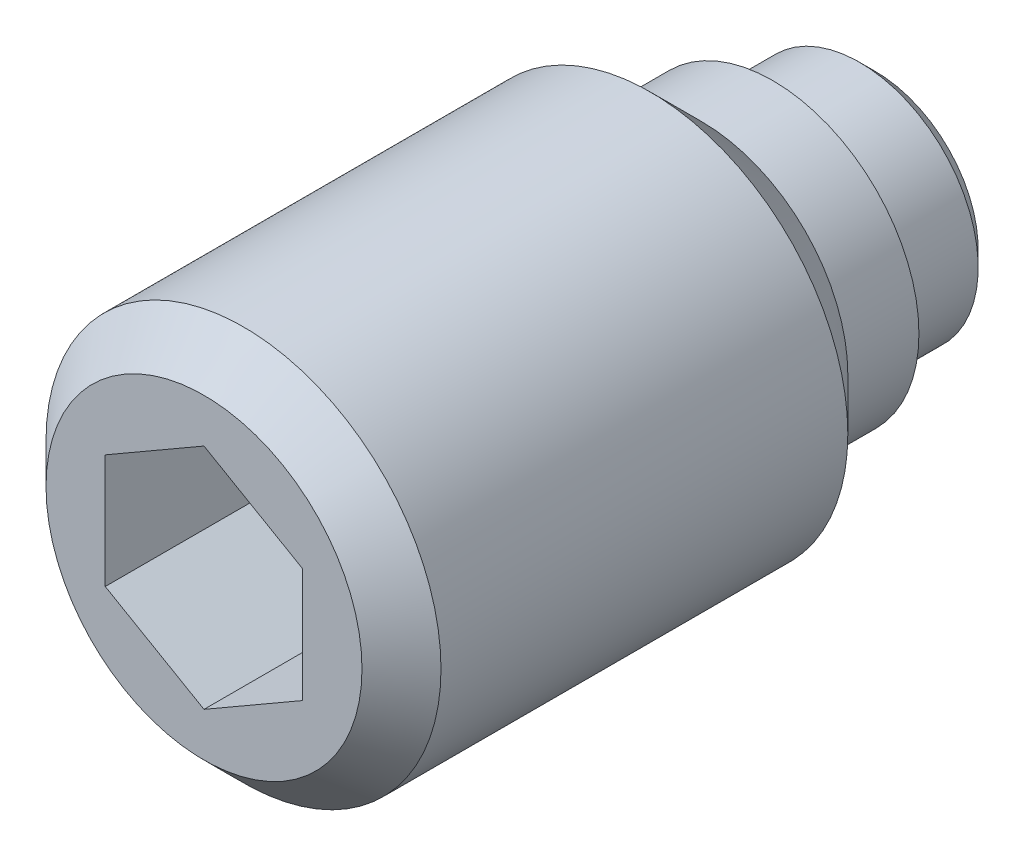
ISO-10303-21;
HEADER;
FILE_DESCRIPTION(('STEP AP214'),'2;1');
FILE_NAME('part.step','',(''),(''),'','','');
FILE_SCHEMA(('AUTOMOTIVE_DESIGN { 1 0 10303 214 1 1 1 1 }'));
ENDSEC;
DATA;
#1=APPLICATION_CONTEXT('core data for automotive mechanical design processes');
#2=APPLICATION_PROTOCOL_DEFINITION('international standard','automotive_design',2000,#1);
#3=PRODUCT_CONTEXT('',#1,'mechanical');
#4=PRODUCT('Part','Part','',(#3));
#5=PRODUCT_RELATED_PRODUCT_CATEGORY('part','',(#4));
#6=PRODUCT_DEFINITION_FORMATION('','',#4);
#7=PRODUCT_DEFINITION_CONTEXT('part definition',#1,'design');
#8=PRODUCT_DEFINITION('design','',#6,#7);
#9=PRODUCT_DEFINITION_SHAPE('','',#8);
#10=(LENGTH_UNIT() NAMED_UNIT(*) SI_UNIT(.MILLI.,.METRE.));
#11=(NAMED_UNIT(*) PLANE_ANGLE_UNIT() SI_UNIT($,.RADIAN.));
#12=(NAMED_UNIT(*) SI_UNIT($,.STERADIAN.) SOLID_ANGLE_UNIT());
#13=UNCERTAINTY_MEASURE_WITH_UNIT(LENGTH_MEASURE(1.E-05),#10,'distance_accuracy_value','');
#14=(GEOMETRIC_REPRESENTATION_CONTEXT(3) GLOBAL_UNCERTAINTY_ASSIGNED_CONTEXT((#13)) GLOBAL_UNIT_ASSIGNED_CONTEXT((#10,
#11,#12)) REPRESENTATION_CONTEXT('',''));
#15=CARTESIAN_POINT('',(0.,0.,0.));
#16=DIRECTION('',(0.,0.,1.));
#17=DIRECTION('',(1.,0.,0.));
#18=AXIS2_PLACEMENT_3D('',#15,#16,#17);
#19=CARTESIAN_POINT('',(0.,1.85,1.8));
#20=DIRECTION('',(0.,0.,1.));
#21=DIRECTION('',(1.,0.,0.));
#22=AXIS2_PLACEMENT_3D('',#19,#20,#21);
#23=PLANE('',#22);
#24=CARTESIAN_POINT('',(0.,0.,1.8));
#25=DIRECTION('',(0.,0.,-1.));
#26=DIRECTION('',(-1.,0.,0.));
#27=AXIS2_PLACEMENT_3D('',#24,#25,#26);
#28=CIRCLE('',#27,1.5);
#29=CARTESIAN_POINT('',(-1.5,0.,1.8));
#30=VERTEX_POINT('',#29);
#31=EDGE_CURVE('E103',#30,#30,#28,.T.);
#32=ORIENTED_EDGE('',*,*,#31,.F.);
#33=EDGE_LOOP('',(#32));
#34=FACE_BOUND('',#33,.T.);
#35=CARTESIAN_POINT('',(0.,0.,1.8));
#36=DIRECTION('',(0.,0.,-1.));
#37=DIRECTION('',(-1.,0.,0.));
#38=AXIS2_PLACEMENT_3D('',#35,#36,#37);
#39=CIRCLE('',#38,1.85);
#40=CARTESIAN_POINT('',(-1.85,0.,1.8));
#41=VERTEX_POINT('',#40);
#42=EDGE_CURVE('E123',#41,#41,#39,.T.);
#43=ORIENTED_EDGE('',*,*,#42,.T.);
#44=EDGE_LOOP('',(#43));
#45=FACE_BOUND('',#44,.T.);
#46=ADVANCED_FACE('F14',(#34,#45),#23,.F.);
#47=CARTESIAN_POINT('',(0.,0.,9.));
#48=DIRECTION('',(0.,0.,-1.));
#49=DIRECTION('',(-1.,0.,0.));
#50=AXIS2_PLACEMENT_3D('',#47,#48,#49);
#51=PLANE('',#50);
#52=CARTESIAN_POINT('',(0.,0.,9.));
#53=DIRECTION('',(0.,0.,-1.));
#54=DIRECTION('',(-1.,0.,0.));
#55=AXIS2_PLACEMENT_3D('',#52,#53,#54);
#56=CIRCLE('',#55,2.);
#57=CARTESIAN_POINT('',(-2.,0.,9.));
#58=VERTEX_POINT('',#57);
#59=EDGE_CURVE('E9',#58,#58,#56,.T.);
#60=ORIENTED_EDGE('',*,*,#59,.F.);
#61=EDGE_LOOP('',(#60));
#62=FACE_BOUND('',#61,.T.);
#63=DIRECTION('',(0.866025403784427,-0.50000000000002,0.));
#64=VECTOR('',#63,1.);
#65=CARTESIAN_POINT('',(0.,1.4433756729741,9.));
#66=LINE('',#65,#64);
#67=CARTESIAN_POINT('',(0.,1.4433756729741,9.));
#68=VERTEX_POINT('',#67);
#69=CARTESIAN_POINT('',(1.25,0.72168783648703,9.));
#70=VERTEX_POINT('',#69);
#71=EDGE_CURVE('E29',#68,#70,#66,.T.);
#72=ORIENTED_EDGE('',*,*,#71,.T.);
#73=DIRECTION('',(0.,-1.,0.));
#74=VECTOR('',#73,1.);
#75=CARTESIAN_POINT('',(1.25,0.72168783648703,9.));
#76=LINE('',#75,#74);
#77=CARTESIAN_POINT('',(1.25,-0.72168783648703,9.));
#78=VERTEX_POINT('',#77);
#79=EDGE_CURVE('E102',#70,#78,#76,.T.);
#80=ORIENTED_EDGE('',*,*,#79,.T.);
#81=DIRECTION('',(-0.866025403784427,-0.50000000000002,0.));
#82=VECTOR('',#81,1.);
#83=CARTESIAN_POINT('',(1.25,-0.72168783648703,9.));
#84=LINE('',#83,#82);
#85=CARTESIAN_POINT('',(0.,-1.4433756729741,9.));
#86=VERTEX_POINT('',#85);
#87=EDGE_CURVE('E106',#78,#86,#84,.T.);
#88=ORIENTED_EDGE('',*,*,#87,.T.);
#89=DIRECTION('',(-0.866025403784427,0.50000000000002,0.));
#90=VECTOR('',#89,1.);
#91=CARTESIAN_POINT('',(0.,-1.4433756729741,9.));
#92=LINE('',#91,#90);
#93=CARTESIAN_POINT('',(-1.25,-0.72168783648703,9.));
#94=VERTEX_POINT('',#93);
#95=EDGE_CURVE('E109',#86,#94,#92,.T.);
#96=ORIENTED_EDGE('',*,*,#95,.T.);
#97=DIRECTION('',(0.,1.,0.));
#98=VECTOR('',#97,1.);
#99=CARTESIAN_POINT('',(-1.25,-0.72168783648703,9.));
#100=LINE('',#99,#98);
#101=CARTESIAN_POINT('',(-1.25,0.72168783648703,9.));
#102=VERTEX_POINT('',#101);
#103=EDGE_CURVE('E92',#94,#102,#100,.T.);
#104=ORIENTED_EDGE('',*,*,#103,.T.);
#105=DIRECTION('',(0.866025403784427,0.50000000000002,0.));
#106=VECTOR('',#105,1.);
#107=CARTESIAN_POINT('',(-1.25,0.72168783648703,9.));
#108=LINE('',#107,#106);
#109=EDGE_CURVE('E112',#102,#68,#108,.T.);
#110=ORIENTED_EDGE('',*,*,#109,.T.);
#111=EDGE_LOOP('',(#72,#80,#88,#96,#104,#110));
#112=FACE_BOUND('',#111,.T.);
#113=ADVANCED_FACE('F16',(#62,#112),#51,.F.);
#114=CARTESIAN_POINT('',(0.,0.,9.));
#115=DIRECTION('',(0.,0.,-1.));
#116=DIRECTION('',(-1.,0.,0.));
#117=AXIS2_PLACEMENT_3D('',#114,#115,#116);
#118=CONICAL_SURFACE('',#117,2.,0.785398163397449);
#119=CARTESIAN_POINT('',(0.,0.,8.5));
#120=DIRECTION('',(0.,0.,-1.));
#121=DIRECTION('',(-1.,0.,0.));
#122=AXIS2_PLACEMENT_3D('',#119,#120,#121);
#123=CIRCLE('',#122,2.5);
#124=CARTESIAN_POINT('',(-2.5,0.,8.5));
#125=VERTEX_POINT('',#124);
#126=EDGE_CURVE('E22',#125,#125,#123,.T.);
#127=ORIENTED_EDGE('',*,*,#126,.F.);
#128=EDGE_LOOP('',(#127));
#129=FACE_BOUND('',#128,.T.);
#130=ORIENTED_EDGE('',*,*,#59,.T.);
#131=EDGE_LOOP('',(#130));
#132=FACE_BOUND('',#131,.T.);
#133=ADVANCED_FACE('F136',(#129,#132),#118,.T.);
#134=CARTESIAN_POINT('',(0.,0.,1.8));
#135=DIRECTION('',(0.,0.,-1.));
#136=DIRECTION('',(-1.,0.,0.));
#137=AXIS2_PLACEMENT_3D('',#134,#135,#136);
#138=CYLINDRICAL_SURFACE('',#137,2.5);
#139=CARTESIAN_POINT('',(0.,0.,3.35));
#140=DIRECTION('',(0.,0.,-1.));
#141=DIRECTION('',(-1.,0.,0.));
#142=AXIS2_PLACEMENT_3D('',#139,#140,#141);
#143=CIRCLE('',#142,2.5);
#144=CARTESIAN_POINT('',(-2.5,0.,3.35));
#145=VERTEX_POINT('',#144);
#146=EDGE_CURVE('E129',#145,#145,#143,.T.);
#147=ORIENTED_EDGE('',*,*,#146,.F.);
#148=EDGE_LOOP('',(#147));
#149=FACE_BOUND('',#148,.T.);
#150=ORIENTED_EDGE('',*,*,#126,.T.);
#151=EDGE_LOOP('',(#150));
#152=FACE_BOUND('',#151,.T.);
#153=ADVANCED_FACE('F134',(#149,#152),#138,.T.);
#154=CARTESIAN_POINT('',(0.,0.,3.35));
#155=DIRECTION('',(0.,0.,1.));
#156=DIRECTION('',(1.,0.,0.));
#157=AXIS2_PLACEMENT_3D('',#154,#155,#156);
#158=CONICAL_SURFACE('',#157,2.5,0.785398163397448);
#159=CARTESIAN_POINT('',(0.,0.,2.7));
#160=DIRECTION('',(0.,0.,-1.));
#161=DIRECTION('',(-1.,0.,0.));
#162=AXIS2_PLACEMENT_3D('',#159,#160,#161);
#163=CIRCLE('',#162,1.85);
#164=CARTESIAN_POINT('',(-1.85,0.,2.7));
#165=VERTEX_POINT('',#164);
#166=EDGE_CURVE('E126',#165,#165,#163,.T.);
#167=ORIENTED_EDGE('',*,*,#166,.F.);
#168=EDGE_LOOP('',(#167));
#169=FACE_BOUND('',#168,.T.);
#170=ORIENTED_EDGE('',*,*,#146,.T.);
#171=EDGE_LOOP('',(#170));
#172=FACE_BOUND('',#171,.T.);
#173=ADVANCED_FACE('F178',(#169,#172),#158,.T.);
#174=CARTESIAN_POINT('',(0.,0.,1.8));
#175=DIRECTION('',(0.,0.,-1.));
#176=DIRECTION('',(-1.,0.,0.));
#177=AXIS2_PLACEMENT_3D('',#174,#175,#176);
#178=CYLINDRICAL_SURFACE('',#177,1.85);
#179=ORIENTED_EDGE('',*,*,#42,.F.);
#180=EDGE_LOOP('',(#179));
#181=FACE_BOUND('',#180,.T.);
#182=ORIENTED_EDGE('',*,*,#166,.T.);
#183=EDGE_LOOP('',(#182));
#184=FACE_BOUND('',#183,.T.);
#185=ADVANCED_FACE('F165',(#181,#184),#178,.T.);
#186=CARTESIAN_POINT('',(0.,1.4433756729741,6.));
#187=DIRECTION('',(-0.50000000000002,-0.866025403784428,0.));
#188=DIRECTION('',(-0.866025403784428,0.50000000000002,0.));
#189=AXIS2_PLACEMENT_3D('',#186,#187,#188);
#190=PLANE('',#189);
#191=ORIENTED_EDGE('',*,*,#71,.F.);
#192=DIRECTION('',(0.,0.,1.));
#193=VECTOR('',#192,1.);
#194=CARTESIAN_POINT('',(0.,1.4433756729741,6.));
#195=LINE('',#194,#193);
#196=CARTESIAN_POINT('',(0.,1.4433756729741,6.));
#197=VERTEX_POINT('',#196);
#198=EDGE_CURVE('E97',#197,#68,#195,.T.);
#199=ORIENTED_EDGE('',*,*,#198,.F.);
#200=DIRECTION('',(0.866025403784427,-0.50000000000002,0.));
#201=VECTOR('',#200,1.);
#202=CARTESIAN_POINT('',(0.,1.4433756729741,6.));
#203=LINE('',#202,#201);
#204=CARTESIAN_POINT('',(1.25,0.72168783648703,6.));
#205=VERTEX_POINT('',#204);
#206=EDGE_CURVE('E115',#197,#205,#203,.T.);
#207=ORIENTED_EDGE('',*,*,#206,.T.);
#208=DIRECTION('',(0.,0.,1.));
#209=VECTOR('',#208,1.);
#210=CARTESIAN_POINT('',(1.25,0.72168783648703,6.));
#211=LINE('',#210,#209);
#212=EDGE_CURVE('E121',#205,#70,#211,.T.);
#213=ORIENTED_EDGE('',*,*,#212,.T.);
#214=EDGE_LOOP('',(#191,#199,#207,#213));
#215=FACE_BOUND('',#214,.T.);
#216=ADVANCED_FACE('F144',(#215),#190,.T.);
#217=CARTESIAN_POINT('',(1.25,0.72168783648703,6.));
#218=DIRECTION('',(-1.,0.,0.));
#219=DIRECTION('',(0.,0.,1.));
#220=AXIS2_PLACEMENT_3D('',#217,#218,#219);
#221=PLANE('',#220);
#222=ORIENTED_EDGE('',*,*,#79,.F.);
#223=ORIENTED_EDGE('',*,*,#212,.F.);
#224=DIRECTION('',(0.,-1.,0.));
#225=VECTOR('',#224,1.);
#226=CARTESIAN_POINT('',(1.25,0.72168783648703,6.));
#227=LINE('',#226,#225);
#228=CARTESIAN_POINT('',(1.25,-0.72168783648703,6.));
#229=VERTEX_POINT('',#228);
#230=EDGE_CURVE('E69',#205,#229,#227,.T.);
#231=ORIENTED_EDGE('',*,*,#230,.T.);
#232=DIRECTION('',(0.,0.,1.));
#233=VECTOR('',#232,1.);
#234=CARTESIAN_POINT('',(1.25,-0.72168783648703,6.));
#235=LINE('',#234,#233);
#236=EDGE_CURVE('E119',#229,#78,#235,.T.);
#237=ORIENTED_EDGE('',*,*,#236,.T.);
#238=EDGE_LOOP('',(#222,#223,#231,#237));
#239=FACE_BOUND('',#238,.T.);
#240=ADVANCED_FACE('F155',(#239),#221,.T.);
#241=CARTESIAN_POINT('',(1.25,-0.72168783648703,6.));
#242=DIRECTION('',(-0.50000000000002,0.866025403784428,0.));
#243=DIRECTION('',(0.866025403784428,0.50000000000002,0.));
#244=AXIS2_PLACEMENT_3D('',#241,#242,#243);
#245=PLANE('',#244);
#246=ORIENTED_EDGE('',*,*,#87,.F.);
#247=ORIENTED_EDGE('',*,*,#236,.F.);
#248=DIRECTION('',(-0.866025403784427,-0.50000000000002,0.));
#249=VECTOR('',#248,1.);
#250=CARTESIAN_POINT('',(1.25,-0.72168783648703,6.));
#251=LINE('',#250,#249);
#252=CARTESIAN_POINT('',(0.,-1.4433756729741,6.));
#253=VERTEX_POINT('',#252);
#254=EDGE_CURVE('E88',#229,#253,#251,.T.);
#255=ORIENTED_EDGE('',*,*,#254,.T.);
#256=DIRECTION('',(0.,0.,1.));
#257=VECTOR('',#256,1.);
#258=CARTESIAN_POINT('',(0.,-1.4433756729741,6.));
#259=LINE('',#258,#257);
#260=EDGE_CURVE('E85',#253,#86,#259,.T.);
#261=ORIENTED_EDGE('',*,*,#260,.T.);
#262=EDGE_LOOP('',(#246,#247,#255,#261));
#263=FACE_BOUND('',#262,.T.);
#264=ADVANCED_FACE('F153',(#263),#245,.T.);
#265=CARTESIAN_POINT('',(0.,-1.4433756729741,6.));
#266=DIRECTION('',(0.50000000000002,0.866025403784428,0.));
#267=DIRECTION('',(0.866025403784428,-0.50000000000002,0.));
#268=AXIS2_PLACEMENT_3D('',#265,#266,#267);
#269=PLANE('',#268);
#270=ORIENTED_EDGE('',*,*,#95,.F.);
#271=ORIENTED_EDGE('',*,*,#260,.F.);
#272=DIRECTION('',(-0.866025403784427,0.50000000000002,0.));
#273=VECTOR('',#272,1.);
#274=CARTESIAN_POINT('',(0.,-1.4433756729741,6.));
#275=LINE('',#274,#273);
#276=CARTESIAN_POINT('',(-1.25,-0.72168783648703,6.));
#277=VERTEX_POINT('',#276);
#278=EDGE_CURVE('E80',#253,#277,#275,.T.);
#279=ORIENTED_EDGE('',*,*,#278,.T.);
#280=DIRECTION('',(0.,0.,1.));
#281=VECTOR('',#280,1.);
#282=CARTESIAN_POINT('',(-1.25,-0.72168783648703,6.));
#283=LINE('',#282,#281);
#284=EDGE_CURVE('E84',#277,#94,#283,.T.);
#285=ORIENTED_EDGE('',*,*,#284,.T.);
#286=EDGE_LOOP('',(#270,#271,#279,#285));
#287=FACE_BOUND('',#286,.T.);
#288=ADVANCED_FACE('F83',(#287),#269,.T.);
#289=CARTESIAN_POINT('',(-1.25,-0.72168783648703,6.));
#290=DIRECTION('',(1.,0.,0.));
#291=DIRECTION('',(0.,0.,-1.));
#292=AXIS2_PLACEMENT_3D('',#289,#290,#291);
#293=PLANE('',#292);
#294=ORIENTED_EDGE('',*,*,#103,.F.);
#295=ORIENTED_EDGE('',*,*,#284,.F.);
#296=DIRECTION('',(0.,1.,0.));
#297=VECTOR('',#296,1.);
#298=CARTESIAN_POINT('',(-1.25,-0.72168783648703,6.));
#299=LINE('',#298,#297);
#300=CARTESIAN_POINT('',(-1.25,0.72168783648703,6.));
#301=VERTEX_POINT('',#300);
#302=EDGE_CURVE('E87',#277,#301,#299,.T.);
#303=ORIENTED_EDGE('',*,*,#302,.T.);
#304=DIRECTION('',(0.,0.,1.));
#305=VECTOR('',#304,1.);
#306=CARTESIAN_POINT('',(-1.25,0.72168783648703,6.));
#307=LINE('',#306,#305);
#308=EDGE_CURVE('E60',#301,#102,#307,.T.);
#309=ORIENTED_EDGE('',*,*,#308,.T.);
#310=EDGE_LOOP('',(#294,#295,#303,#309));
#311=FACE_BOUND('',#310,.T.);
#312=ADVANCED_FACE('F90',(#311),#293,.T.);
#313=CARTESIAN_POINT('',(-1.25,0.72168783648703,6.));
#314=DIRECTION('',(0.50000000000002,-0.866025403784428,0.));
#315=DIRECTION('',(-0.866025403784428,-0.50000000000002,0.));
#316=AXIS2_PLACEMENT_3D('',#313,#314,#315);
#317=PLANE('',#316);
#318=ORIENTED_EDGE('',*,*,#109,.F.);
#319=ORIENTED_EDGE('',*,*,#308,.F.);
#320=DIRECTION('',(0.866025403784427,0.50000000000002,0.));
#321=VECTOR('',#320,1.);
#322=CARTESIAN_POINT('',(-1.25,0.72168783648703,6.));
#323=LINE('',#322,#321);
#324=EDGE_CURVE('E37',#301,#197,#323,.T.);
#325=ORIENTED_EDGE('',*,*,#324,.T.);
#326=ORIENTED_EDGE('',*,*,#198,.T.);
#327=EDGE_LOOP('',(#318,#319,#325,#326));
#328=FACE_BOUND('',#327,.T.);
#329=ADVANCED_FACE('F143',(#328),#317,.T.);
#330=CARTESIAN_POINT('',(0.,0.,6.));
#331=DIRECTION('',(0.,0.,-1.));
#332=DIRECTION('',(-1.,0.,0.));
#333=AXIS2_PLACEMENT_3D('',#330,#331,#332);
#334=PLANE('',#333);
#335=ORIENTED_EDGE('',*,*,#206,.F.);
#336=ORIENTED_EDGE('',*,*,#324,.F.);
#337=ORIENTED_EDGE('',*,*,#302,.F.);
#338=ORIENTED_EDGE('',*,*,#278,.F.);
#339=ORIENTED_EDGE('',*,*,#254,.F.);
#340=ORIENTED_EDGE('',*,*,#230,.F.);
#341=EDGE_LOOP('',(#335,#336,#337,#338,#339,#340));
#342=FACE_BOUND('',#341,.T.);
#343=ADVANCED_FACE('F95',(#342),#334,.F.);
#344=CARTESIAN_POINT('',(0.,0.,0.));
#345=DIRECTION('',(0.,0.,-1.));
#346=DIRECTION('',(-1.,0.,0.));
#347=AXIS2_PLACEMENT_3D('',#344,#345,#346);
#348=CYLINDRICAL_SURFACE('',#347,1.5);
#349=CARTESIAN_POINT('',(0.,0.,0.7));
#350=DIRECTION('',(0.,0.,-1.));
#351=DIRECTION('',(-1.,0.,0.));
#352=AXIS2_PLACEMENT_3D('',#349,#350,#351);
#353=CIRCLE('',#352,1.5);
#354=CARTESIAN_POINT('',(-1.5,0.,0.7));
#355=VERTEX_POINT('',#354);
#356=EDGE_CURVE('E322',#355,#355,#353,.T.);
#357=ORIENTED_EDGE('',*,*,#356,.F.);
#358=EDGE_LOOP('',(#357));
#359=FACE_BOUND('',#358,.T.);
#360=ORIENTED_EDGE('',*,*,#31,.T.);
#361=EDGE_LOOP('',(#360));
#362=FACE_BOUND('',#361,.T.);
#363=ADVANCED_FACE('F263',(#359,#362),#348,.T.);
#364=CARTESIAN_POINT('',(0.,0.,0.7));
#365=DIRECTION('',(0.,0.,1.));
#366=DIRECTION('',(1.,0.,0.));
#367=AXIS2_PLACEMENT_3D('',#364,#365,#366);
#368=CONICAL_SURFACE('',#367,1.5,0.785398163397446);
#369=CARTESIAN_POINT('',(0.,0.,0.5));
#370=DIRECTION('',(0.,0.,-1.));
#371=DIRECTION('',(-1.,0.,0.));
#372=AXIS2_PLACEMENT_3D('',#369,#370,#371);
#373=CIRCLE('',#372,1.3);
#374=CARTESIAN_POINT('',(-1.3,0.,0.5));
#375=VERTEX_POINT('',#374);
#376=EDGE_CURVE('E319',#375,#375,#373,.T.);
#377=ORIENTED_EDGE('',*,*,#376,.F.);
#378=EDGE_LOOP('',(#377));
#379=FACE_BOUND('',#378,.T.);
#380=ORIENTED_EDGE('',*,*,#356,.T.);
#381=EDGE_LOOP('',(#380));
#382=FACE_BOUND('',#381,.T.);
#383=ADVANCED_FACE('F270',(#379,#382),#368,.T.);
#384=CARTESIAN_POINT('',(0.,1.3,0.5));
#385=DIRECTION('',(0.,0.,1.));
#386=DIRECTION('',(1.,0.,0.));
#387=AXIS2_PLACEMENT_3D('',#384,#385,#386);
#388=PLANE('',#387);
#389=CARTESIAN_POINT('',(0.,0.,0.5));
#390=DIRECTION('',(0.,0.,-1.));
#391=DIRECTION('',(-1.,0.,0.));
#392=AXIS2_PLACEMENT_3D('',#389,#390,#391);
#393=CIRCLE('',#392,0.5);
#394=CARTESIAN_POINT('',(-0.5,0.,0.5));
#395=VERTEX_POINT('',#394);
#396=EDGE_CURVE('E318',#395,#395,#393,.T.);
#397=ORIENTED_EDGE('',*,*,#396,.F.);
#398=EDGE_LOOP('',(#397));
#399=FACE_BOUND('',#398,.T.);
#400=ORIENTED_EDGE('',*,*,#376,.T.);
#401=EDGE_LOOP('',(#400));
#402=FACE_BOUND('',#401,.T.);
#403=ADVANCED_FACE('F278',(#399,#402),#388,.F.);
#404=CARTESIAN_POINT('',(0.,0.,0.5));
#405=DIRECTION('',(0.,0.,1.));
#406=DIRECTION('',(1.,0.,0.));
#407=AXIS2_PLACEMENT_3D('',#404,#405,#406);
#408=CONICAL_SURFACE('',#407,0.5,0.785398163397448);
#409=CARTESIAN_POINT('',(0.,0.,0.));
#410=VERTEX_POINT('',#409);
#411=VERTEX_LOOP('',#410);
#412=FACE_BOUND('',#411,.T.);
#413=ORIENTED_EDGE('',*,*,#396,.T.);
#414=EDGE_LOOP('',(#413));
#415=FACE_BOUND('',#414,.T.);
#416=ADVANCED_FACE('F286',(#412,#415),#408,.T.);
#417=CLOSED_SHELL('',(#46,#113,#133,#153,#173,#185,#216,#240,#264,#288,#312,#329,#343,#363,#383,
#403,#416));
#418=MANIFOLD_SOLID_BREP('B1',#417);
#419=ADVANCED_BREP_SHAPE_REPRESENTATION('',(#18,#418),#14);
#420=SHAPE_DEFINITION_REPRESENTATION(#9,#419);
ENDSEC;
END-ISO-10303-21;
